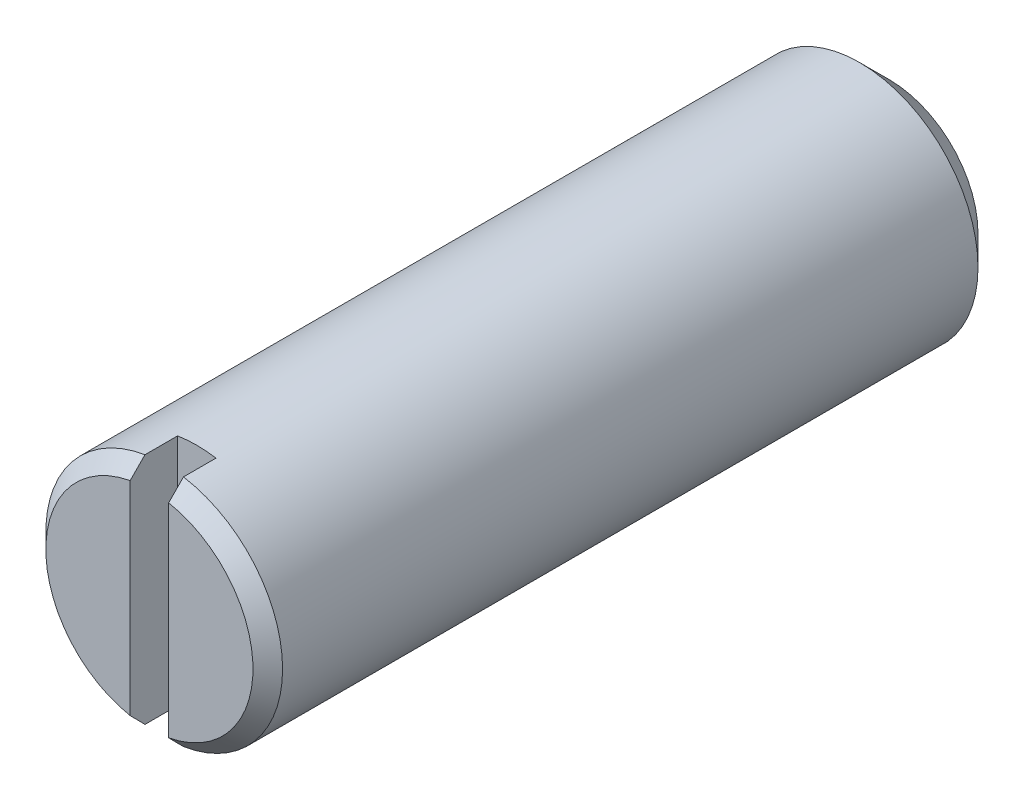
ISO-10303-21;
HEADER;
FILE_DESCRIPTION(('STEP AP214'),'2;1');
FILE_NAME('part.step','',(''),(''),'','','');
FILE_SCHEMA(('AUTOMOTIVE_DESIGN { 1 0 10303 214 1 1 1 1 }'));
ENDSEC;
DATA;
#1=APPLICATION_CONTEXT('core data for automotive mechanical design processes');
#2=APPLICATION_PROTOCOL_DEFINITION('international standard','automotive_design',2000,#1);
#3=PRODUCT_CONTEXT('',#1,'mechanical');
#4=PRODUCT('Part','Part','',(#3));
#5=PRODUCT_RELATED_PRODUCT_CATEGORY('part','',(#4));
#6=PRODUCT_DEFINITION_FORMATION('','',#4);
#7=PRODUCT_DEFINITION_CONTEXT('part definition',#1,'design');
#8=PRODUCT_DEFINITION('design','',#6,#7);
#9=PRODUCT_DEFINITION_SHAPE('','',#8);
#10=(LENGTH_UNIT() NAMED_UNIT(*) SI_UNIT(.MILLI.,.METRE.));
#11=(NAMED_UNIT(*) PLANE_ANGLE_UNIT() SI_UNIT($,.RADIAN.));
#12=(NAMED_UNIT(*) SI_UNIT($,.STERADIAN.) SOLID_ANGLE_UNIT());
#13=UNCERTAINTY_MEASURE_WITH_UNIT(LENGTH_MEASURE(1.E-05),#10,'distance_accuracy_value','');
#14=(GEOMETRIC_REPRESENTATION_CONTEXT(3) GLOBAL_UNCERTAINTY_ASSIGNED_CONTEXT((#13)) GLOBAL_UNIT_ASSIGNED_CONTEXT((#10,
#11,#12)) REPRESENTATION_CONTEXT('',''));
#15=CARTESIAN_POINT('',(0.,0.,0.));
#16=DIRECTION('',(0.,0.,1.));
#17=DIRECTION('',(1.,0.,0.));
#18=AXIS2_PLACEMENT_3D('',#15,#16,#17);
#19=CARTESIAN_POINT('',(0.,0.,25.));
#20=DIRECTION('',(0.,0.,-1.));
#21=DIRECTION('',(-1.,0.,0.));
#22=AXIS2_PLACEMENT_3D('',#19,#20,#21);
#23=PLANE('',#22);
#24=DIRECTION('',(0.,1.,0.));
#25=VECTOR('',#24,1.);
#26=CARTESIAN_POINT('',(-0.65,3.94683417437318,25.));
#27=LINE('',#26,#25);
#28=CARTESIAN_POINT('',(-0.65,-3.43911325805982,25.0000000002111));
#29=VERTEX_POINT('',#28);
#30=CARTESIAN_POINT('',(-0.65,3.43911325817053,25.0000000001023));
#31=VERTEX_POINT('',#30);
#32=EDGE_CURVE('E148',#29,#31,#27,.T.);
#33=ORIENTED_EDGE('',*,*,#32,.T.);
#34=CARTESIAN_POINT('',(0.,0.,25.0000000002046));
#35=DIRECTION('',(0.,0.,-1.));
#36=DIRECTION('',(-1.,0.,0.));
#37=AXIS2_PLACEMENT_3D('',#34,#35,#36);
#38=CIRCLE('',#37,3.5000000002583);
#39=EDGE_CURVE('E79',#29,#31,#38,.T.);
#40=ORIENTED_EDGE('',*,*,#39,.F.);
#41=EDGE_LOOP('',(#33,#40));
#42=FACE_BOUND('',#41,.T.);
#43=ADVANCED_FACE('F15',(#42),#23,.F.);
#44=CARTESIAN_POINT('',(0.,0.,25.));
#45=DIRECTION('',(0.,0.,-1.));
#46=DIRECTION('',(-1.,0.,0.));
#47=AXIS2_PLACEMENT_3D('',#44,#45,#46);
#48=PLANE('',#47);
#49=DIRECTION('',(0.,1.,0.));
#50=VECTOR('',#49,1.);
#51=CARTESIAN_POINT('',(0.65,-3.94683417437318,25.));
#52=LINE('',#51,#50);
#53=CARTESIAN_POINT('',(0.65,3.43911325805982,25.0000000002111));
#54=VERTEX_POINT('',#53);
#55=CARTESIAN_POINT('',(0.65,-3.43911325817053,25.0000000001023));
#56=VERTEX_POINT('',#55);
#57=EDGE_CURVE('E67',#54,#56,#52,.F.);
#58=ORIENTED_EDGE('',*,*,#57,.T.);
#59=CARTESIAN_POINT('',(0.,0.,25.0000000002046));
#60=DIRECTION('',(0.,0.,-1.));
#61=DIRECTION('',(-1.,0.,0.));
#62=AXIS2_PLACEMENT_3D('',#59,#60,#61);
#63=CIRCLE('',#62,3.5000000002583);
#64=EDGE_CURVE('E18',#54,#56,#63,.T.);
#65=ORIENTED_EDGE('',*,*,#64,.F.);
#66=EDGE_LOOP('',(#58,#65));
#67=FACE_BOUND('',#66,.T.);
#68=ADVANCED_FACE('F68',(#67),#48,.F.);
#69=CARTESIAN_POINT('',(0.,0.,0.));
#70=DIRECTION('',(0.,0.,-1.));
#71=DIRECTION('',(-1.,0.,0.));
#72=AXIS2_PLACEMENT_3D('',#69,#70,#71);
#73=PLANE('',#72);
#74=CARTESIAN_POINT('',(0.,0.,-4.54747350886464E-10));
#75=DIRECTION('',(0.,0.,1.));
#76=DIRECTION('',(1.,0.,0.));
#77=AXIS2_PLACEMENT_3D('',#74,#75,#76);
#78=CIRCLE('',#77,3.00000000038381);
#79=CARTESIAN_POINT('',(3.00000000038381,0.,-4.54747350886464E-10));
#80=VERTEX_POINT('',#79);
#81=EDGE_CURVE('E152',#80,#80,#78,.T.);
#82=ORIENTED_EDGE('',*,*,#81,.F.);
#83=EDGE_LOOP('',(#82));
#84=FACE_BOUND('',#83,.T.);
#85=ADVANCED_FACE('F111',(#84),#73,.T.);
#86=CARTESIAN_POINT('',(0.,0.,24.4999999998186));
#87=DIRECTION('',(0.,0.,-1.));
#88=DIRECTION('',(-1.,0.,0.));
#89=AXIS2_PLACEMENT_3D('',#86,#87,#88);
#90=CONICAL_SURFACE('',#89,3.99999999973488,0.785398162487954);
#91=CARTESIAN_POINT('',(0.650000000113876,3.94683417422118,24.499999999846));
#92=CARTESIAN_POINT('',(0.650000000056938,3.86230046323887,24.5834211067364));
#93=CARTESIAN_POINT('',(0.650000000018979,3.77772353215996,24.6667983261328));
#94=CARTESIAN_POINT('',(0.649999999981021,3.60848322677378,24.8334649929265));
#95=CARTESIAN_POINT('',(0.649999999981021,3.52381985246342,24.9167544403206));
#96=CARTESIAN_POINT('',(0.65,3.43911325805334,25.0000000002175));
#97=B_SPLINE_CURVE_WITH_KNOTS('',3,(#91,#92,#93,#94,#95,#96),.UNSPECIFIED.,.F.,.F.,(4,2,4),(0.,
0.35629364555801,0.712587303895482),.UNSPECIFIED.);
#98=CARTESIAN_POINT('',(0.65,3.94683417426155,24.4999999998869));
#99=VERTEX_POINT('',#98);
#100=EDGE_CURVE('E78',#99,#54,#97,.T.);
#101=ORIENTED_EDGE('',*,*,#100,.T.);
#102=ORIENTED_EDGE('',*,*,#64,.T.);
#103=CARTESIAN_POINT('',(0.649999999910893,-3.4391132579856,25.0000000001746));
#104=CARTESIAN_POINT('',(0.649999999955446,-3.52381985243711,24.9167544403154));
#105=CARTESIAN_POINT('',(0.649999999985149,-3.60848322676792,24.8334649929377));
#106=CARTESIAN_POINT('',(0.650000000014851,-3.77772353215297,24.6667983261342));
#107=CARTESIAN_POINT('',(0.650000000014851,-3.86230046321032,24.5834211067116));
#108=CARTESIAN_POINT('',(0.65,-3.94683417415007,24.4999999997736));
#109=B_SPLINE_CURVE_WITH_KNOTS('',3,(#103,#104,#105,#106,#107,#108),.UNSPECIFIED.,.F.,.F.,(4,2,
4),(0.,0.356293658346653,0.712587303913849),.UNSPECIFIED.);
#110=CARTESIAN_POINT('',(0.65,-3.94683417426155,24.4999999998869));
#111=VERTEX_POINT('',#110);
#112=EDGE_CURVE('E72',#56,#111,#109,.T.);
#113=ORIENTED_EDGE('',*,*,#112,.T.);
#114=CARTESIAN_POINT('',(0.,0.,24.5));
#115=DIRECTION('',(0.,0.,1.));
#116=DIRECTION('',(1.,0.,0.));
#117=AXIS2_PLACEMENT_3D('',#114,#115,#116);
#118=CIRCLE('',#117,4.);
#119=EDGE_CURVE('E154',#99,#111,#118,.F.);
#120=ORIENTED_EDGE('',*,*,#119,.F.);
#121=EDGE_LOOP('',(#101,#102,#113,#120));
#122=FACE_BOUND('',#121,.T.);
#123=ADVANCED_FACE('F76',(#122),#90,.T.);
#124=CARTESIAN_POINT('',(0.,0.,24.4999999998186));
#125=DIRECTION('',(0.,0.,-1.));
#126=DIRECTION('',(-1.,0.,0.));
#127=AXIS2_PLACEMENT_3D('',#124,#125,#126);
#128=CONICAL_SURFACE('',#127,3.99999999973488,0.785398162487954);
#129=CARTESIAN_POINT('',(-0.650000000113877,-3.94683417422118,24.499999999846));
#130=CARTESIAN_POINT('',(-0.650000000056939,-3.86230046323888,24.5834211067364));
#131=CARTESIAN_POINT('',(-0.65000000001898,-3.77772353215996,24.6667983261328));
#132=CARTESIAN_POINT('',(-0.649999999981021,-3.60848322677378,24.8334649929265));
#133=CARTESIAN_POINT('',(-0.649999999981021,-3.52381985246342,24.9167544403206));
#134=CARTESIAN_POINT('',(-0.65,-3.43911325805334,25.0000000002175));
#135=B_SPLINE_CURVE_WITH_KNOTS('',3,(#129,#130,#131,#132,#133,#134),.UNSPECIFIED.,.F.,.F.,(4,2,
4),(0.,0.356293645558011,0.712587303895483),.UNSPECIFIED.);
#136=CARTESIAN_POINT('',(-0.650000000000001,-3.94683417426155,24.4999999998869));
#137=VERTEX_POINT('',#136);
#138=EDGE_CURVE('E97',#137,#29,#135,.T.);
#139=ORIENTED_EDGE('',*,*,#138,.T.);
#140=ORIENTED_EDGE('',*,*,#39,.T.);
#141=CARTESIAN_POINT('',(-0.649999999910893,3.4391132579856,25.0000000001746));
#142=CARTESIAN_POINT('',(-0.649999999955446,3.52381985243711,24.9167544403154));
#143=CARTESIAN_POINT('',(-0.649999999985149,3.60848322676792,24.8334649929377));
#144=CARTESIAN_POINT('',(-0.650000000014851,3.77772353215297,24.6667983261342));
#145=CARTESIAN_POINT('',(-0.650000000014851,3.86230046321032,24.5834211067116));
#146=CARTESIAN_POINT('',(-0.65,3.94683417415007,24.4999999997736));
#147=B_SPLINE_CURVE_WITH_KNOTS('',3,(#141,#142,#143,#144,#145,#146),.UNSPECIFIED.,.F.,.F.,(4,2,
4),(0.,0.356293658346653,0.712587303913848),.UNSPECIFIED.);
#148=CARTESIAN_POINT('',(-0.65,3.94683417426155,24.4999999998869));
#149=VERTEX_POINT('',#148);
#150=EDGE_CURVE('E166',#31,#149,#147,.T.);
#151=ORIENTED_EDGE('',*,*,#150,.T.);
#152=CARTESIAN_POINT('',(0.,0.,24.5));
#153=DIRECTION('',(0.,0.,1.));
#154=DIRECTION('',(1.,0.,0.));
#155=AXIS2_PLACEMENT_3D('',#152,#153,#154);
#156=CIRCLE('',#155,4.);
#157=EDGE_CURVE('E144',#137,#149,#156,.F.);
#158=ORIENTED_EDGE('',*,*,#157,.F.);
#159=EDGE_LOOP('',(#139,#140,#151,#158));
#160=FACE_BOUND('',#159,.T.);
#161=ADVANCED_FACE('F110',(#160),#128,.T.);
#162=CARTESIAN_POINT('',(-0.65,3.94683417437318,25.));
#163=DIRECTION('',(-1.,0.,0.));
#164=DIRECTION('',(0.,0.,1.));
#165=AXIS2_PLACEMENT_3D('',#162,#163,#164);
#166=PLANE('',#165);
#167=DIRECTION('',(0.,0.,1.));
#168=VECTOR('',#167,1.);
#169=CARTESIAN_POINT('',(-0.650000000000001,-3.94683417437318,0.));
#170=LINE('',#169,#168);
#171=CARTESIAN_POINT('',(-0.650000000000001,-3.94683417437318,23.4));
#172=VERTEX_POINT('',#171);
#173=EDGE_CURVE('E151',#172,#137,#170,.T.);
#174=ORIENTED_EDGE('',*,*,#173,.F.);
#175=DIRECTION('',(0.,1.,0.));
#176=VECTOR('',#175,1.);
#177=CARTESIAN_POINT('',(-0.65,0.,23.4));
#178=LINE('',#177,#176);
#179=CARTESIAN_POINT('',(-0.65,3.94683417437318,23.4));
#180=VERTEX_POINT('',#179);
#181=EDGE_CURVE('E73',#180,#172,#178,.F.);
#182=ORIENTED_EDGE('',*,*,#181,.F.);
#183=DIRECTION('',(0.,0.,1.));
#184=VECTOR('',#183,1.);
#185=CARTESIAN_POINT('',(-0.65,3.94683417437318,0.));
#186=LINE('',#185,#184);
#187=EDGE_CURVE('E141',#149,#180,#186,.F.);
#188=ORIENTED_EDGE('',*,*,#187,.F.);
#189=ORIENTED_EDGE('',*,*,#150,.F.);
#190=ORIENTED_EDGE('',*,*,#32,.F.);
#191=ORIENTED_EDGE('',*,*,#138,.F.);
#192=EDGE_LOOP('',(#174,#182,#188,#189,#190,#191));
#193=FACE_BOUND('',#192,.T.);
#194=ADVANCED_FACE('F175',(#193),#166,.F.);
#195=CARTESIAN_POINT('',(0.,0.,23.4));
#196=DIRECTION('',(0.,0.,1.));
#197=DIRECTION('',(1.,0.,0.));
#198=AXIS2_PLACEMENT_3D('',#195,#196,#197);
#199=PLANE('',#198);
#200=CARTESIAN_POINT('',(0.,0.,23.4));
#201=DIRECTION('',(0.,0.,1.));
#202=DIRECTION('',(1.,0.,0.));
#203=AXIS2_PLACEMENT_3D('',#200,#201,#202);
#204=CIRCLE('',#203,4.);
#205=CARTESIAN_POINT('',(0.65,3.94683417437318,23.4));
#206=VERTEX_POINT('',#205);
#207=EDGE_CURVE('E138',#180,#206,#204,.F.);
#208=ORIENTED_EDGE('',*,*,#207,.F.);
#209=ORIENTED_EDGE('',*,*,#181,.T.);
#210=CARTESIAN_POINT('',(0.,0.,23.4));
#211=DIRECTION('',(0.,0.,1.));
#212=DIRECTION('',(1.,0.,0.));
#213=AXIS2_PLACEMENT_3D('',#210,#211,#212);
#214=CIRCLE('',#213,4.);
#215=CARTESIAN_POINT('',(0.65,-3.94683417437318,23.4));
#216=VERTEX_POINT('',#215);
#217=EDGE_CURVE('E149',#216,#172,#214,.F.);
#218=ORIENTED_EDGE('',*,*,#217,.F.);
#219=DIRECTION('',(0.,1.,0.));
#220=VECTOR('',#219,1.);
#221=CARTESIAN_POINT('',(0.65,-3.94683417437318,23.4));
#222=LINE('',#221,#220);
#223=EDGE_CURVE('E33',#216,#206,#222,.T.);
#224=ORIENTED_EDGE('',*,*,#223,.T.);
#225=EDGE_LOOP('',(#208,#209,#218,#224));
#226=FACE_BOUND('',#225,.T.);
#227=ADVANCED_FACE('F178',(#226),#199,.T.);
#228=CARTESIAN_POINT('',(0.65,-3.94683417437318,25.));
#229=DIRECTION('',(1.,0.,0.));
#230=DIRECTION('',(0.,0.,-1.));
#231=AXIS2_PLACEMENT_3D('',#228,#229,#230);
#232=PLANE('',#231);
#233=DIRECTION('',(0.,0.,1.));
#234=VECTOR('',#233,1.);
#235=CARTESIAN_POINT('',(0.65,3.94683417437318,0.));
#236=LINE('',#235,#234);
#237=EDGE_CURVE('E24',#206,#99,#236,.T.);
#238=ORIENTED_EDGE('',*,*,#237,.F.);
#239=ORIENTED_EDGE('',*,*,#223,.F.);
#240=DIRECTION('',(0.,0.,1.));
#241=VECTOR('',#240,1.);
#242=CARTESIAN_POINT('',(0.65,-3.94683417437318,0.));
#243=LINE('',#242,#241);
#244=EDGE_CURVE('E82',#111,#216,#243,.F.);
#245=ORIENTED_EDGE('',*,*,#244,.F.);
#246=ORIENTED_EDGE('',*,*,#112,.F.);
#247=ORIENTED_EDGE('',*,*,#57,.F.);
#248=ORIENTED_EDGE('',*,*,#100,.F.);
#249=EDGE_LOOP('',(#238,#239,#245,#246,#247,#248));
#250=FACE_BOUND('',#249,.T.);
#251=ADVANCED_FACE('F80',(#250),#232,.F.);
#252=CARTESIAN_POINT('',(0.,0.,1.0000000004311));
#253=DIRECTION('',(0.,0.,1.));
#254=DIRECTION('',(1.,0.,0.));
#255=AXIS2_PLACEMENT_3D('',#252,#253,#254);
#256=CONICAL_SURFACE('',#255,3.99999999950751,0.785398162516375);
#257=ORIENTED_EDGE('',*,*,#81,.T.);
#258=EDGE_LOOP('',(#257));
#259=FACE_BOUND('',#258,.T.);
#260=CARTESIAN_POINT('',(0.,0.,1.));
#261=DIRECTION('',(0.,0.,1.));
#262=DIRECTION('',(1.,0.,0.));
#263=AXIS2_PLACEMENT_3D('',#260,#261,#262);
#264=CIRCLE('',#263,4.);
#265=CARTESIAN_POINT('',(4.,0.,1.));
#266=VERTEX_POINT('',#265);
#267=EDGE_CURVE('E10',#266,#266,#264,.T.);
#268=ORIENTED_EDGE('',*,*,#267,.F.);
#269=EDGE_LOOP('',(#268));
#270=FACE_BOUND('',#269,.T.);
#271=ADVANCED_FACE('F125',(#259,#270),#256,.T.);
#272=CARTESIAN_POINT('',(0.,0.,0.));
#273=DIRECTION('',(0.,0.,1.));
#274=DIRECTION('',(1.,0.,0.));
#275=AXIS2_PLACEMENT_3D('',#272,#273,#274);
#276=CYLINDRICAL_SURFACE('',#275,4.);
#277=ORIENTED_EDGE('',*,*,#267,.T.);
#278=EDGE_LOOP('',(#277));
#279=FACE_BOUND('',#278,.T.);
#280=ORIENTED_EDGE('',*,*,#207,.T.);
#281=ORIENTED_EDGE('',*,*,#237,.T.);
#282=ORIENTED_EDGE('',*,*,#119,.T.);
#283=ORIENTED_EDGE('',*,*,#244,.T.);
#284=ORIENTED_EDGE('',*,*,#217,.T.);
#285=ORIENTED_EDGE('',*,*,#173,.T.);
#286=ORIENTED_EDGE('',*,*,#157,.T.);
#287=ORIENTED_EDGE('',*,*,#187,.T.);
#288=EDGE_LOOP('',(#280,#281,#282,#283,#284,#285,#286,#287));
#289=FACE_BOUND('',#288,.T.);
#290=ADVANCED_FACE('F123',(#279,#289),#276,.T.);
#291=CLOSED_SHELL('',(#43,#68,#85,#123,#161,#194,#227,#251,#271,#290));
#292=MANIFOLD_SOLID_BREP('B1',#291);
#293=ADVANCED_BREP_SHAPE_REPRESENTATION('',(#18,#292),#14);
#294=SHAPE_DEFINITION_REPRESENTATION(#9,#293);
ENDSEC;
END-ISO-10303-21;
